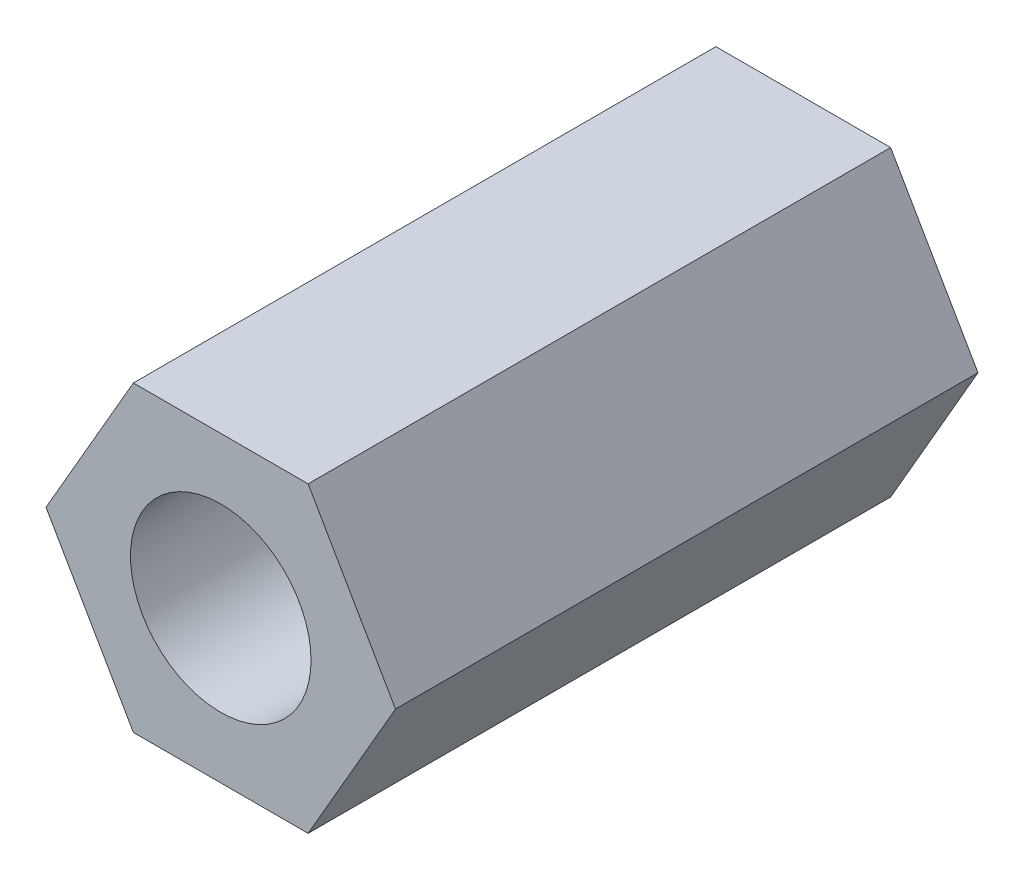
from build123d import *

# Parameters (mm, degrees)
SKETCH_1_R      = 1.55
EXTRUDE_1_DEPTH = 10


with BuildPart() as part:
    # Sketch 1 → Extrude 1 (new body)
    with BuildSketch(Plane.XY):
        Polygon((3, 0), (1.5, 2.598076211), (-1.5, 2.598076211), (-3, 0), (-1.5, -2.598076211), (1.5, -2.598076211), align=None)
        Circle(SKETCH_1_R, mode=Mode.SUBTRACT)
    extrude(amount=EXTRUDE_1_DEPTH)


solid = part.part
